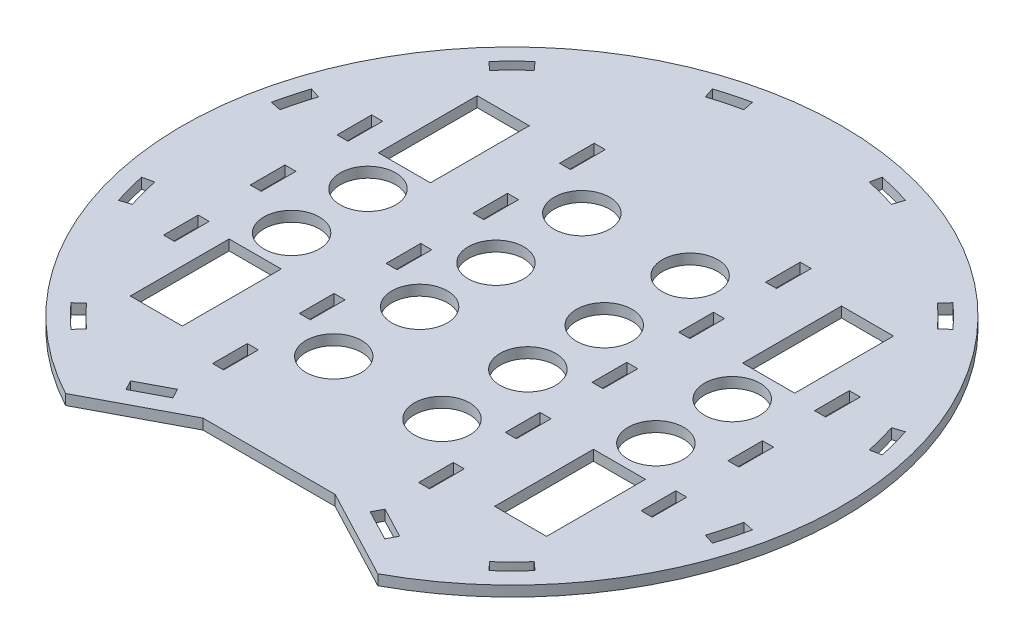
from build123d import *

# Parameters (mm, degrees)
SKETCH1_R           = 16
SKETCH1_W           = 30
SKETCH1_H           = 57
SKETCH1_W_2         = 6.35
SKETCH1_H_2         = 20
BOSS_EXTRUDE1_DEPTH = 6


with BuildPart() as part:
    # Sketch1 → Boss-Extrude1 (new body)
    with BuildSketch(Plane(origin=(0, 0, 0), x_dir=(1, 0, 0), z_dir=(0, 1, 0))):
        with BuildLine():
            Line((-90, -167.332005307), (-38.1, -140))
            Line((-38.1, -140), (38.1, -140))
            Line((38.1, -140), (90, -167.332005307))
            ThreePointArc((90, -167.332005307), (0, 190), (-90, -167.332005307))
        make_face()
        with Locations(Location((-105, -22.009925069, 0), (0, 0, 270))):
            Circle(SKETCH1_R, mode=Mode.SUBTRACT)
        with Locations(Location((-105, 22.009925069, 0), (0, 0, 270))):
            Circle(SKETCH1_R, mode=Mode.SUBTRACT)
        with Locations(Location((105, 22.009925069, 0), (0, 0, 270))):
            Circle(SKETCH1_R, mode=Mode.SUBTRACT)
        with Locations(Location((105, -22.009925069, 0), (0, 0, 270))):
            Circle(SKETCH1_R, mode=Mode.SUBTRACT)
        with Locations(Location((-31.203328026, 22.009925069, 0), (0, 0, 270))):
            Circle(SKETCH1_R, mode=Mode.SUBTRACT)
        with Locations(Location((-31.203328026, 71.509925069, 0), (0, 0, 270))):
            Circle(SKETCH1_R, mode=Mode.SUBTRACT)
        with Locations(Location((-31.203328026, -22.009925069, 0), (0, 0, 270))):
            Circle(SKETCH1_R, mode=Mode.SUBTRACT)
        with Locations(Location((-31.203328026, -71.509925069, 0), (0, 0, 270))):
            Circle(SKETCH1_R, mode=Mode.SUBTRACT)
        with Locations(Location((31.203328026, -71.509925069, 0), (0, 0, 270))):
            Circle(SKETCH1_R, mode=Mode.SUBTRACT)
        with Locations(Location((31.203328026, -22.009925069, 0), (0, 0, 270))):
            Circle(SKETCH1_R, mode=Mode.SUBTRACT)
        with Locations(Location((31.203328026, 71.509925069, 0), (0, 0, 270))):
            Circle(SKETCH1_R, mode=Mode.SUBTRACT)
        with Locations(Location((31.203328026, 22.009925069, 0), (0, 0, 270))):
            Circle(SKETCH1_R, mode=Mode.SUBTRACT)
        with Locations((-105, -71.509925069)):
            Rectangle(SKETCH1_W, SKETCH1_H, mode=Mode.SUBTRACT)
        with Locations((-105, 71.509925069)):
            Rectangle(SKETCH1_W, SKETCH1_H, mode=Mode.SUBTRACT)
        with Locations((105, 71.509925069)):
            Rectangle(SKETCH1_W, SKETCH1_H, mode=Mode.SUBTRACT)
        with Locations((105, -71.509925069)):
            Rectangle(SKETCH1_W, SKETCH1_H, mode=Mode.SUBTRACT)
        with Locations((137.675, -50)):
            Rectangle(SKETCH1_W_2, SKETCH1_H_2, mode=Mode.SUBTRACT)
        with Locations((-137.675, 50)):
            Rectangle(SKETCH1_W_2, SKETCH1_H_2, mode=Mode.SUBTRACT)
        with Locations((-137.675, 0)):
            Rectangle(SKETCH1_W_2, SKETCH1_H_2, mode=Mode.SUBTRACT)
        with Locations((-137.675, -50)):
            Rectangle(SKETCH1_W_2, SKETCH1_H_2, mode=Mode.SUBTRACT)
        with Locations((137.675, 0)):
            Rectangle(SKETCH1_W_2, SKETCH1_H_2, mode=Mode.SUBTRACT)
        with Locations((137.675, 50)):
            Rectangle(SKETCH1_W_2, SKETCH1_H_2, mode=Mode.SUBTRACT)
        with BuildLine():
            Line((-53.660801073, 165.150964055), (-55.623058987, 171.190172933))
            ThreePointArc((-55.623058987, 171.190172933), (-46.587428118, 173.866648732), (-37.424104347, 176.066568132))
            Line((-37.424104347, 176.066568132), (-36.103865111, 169.855330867))
            ThreePointArc((-36.103865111, 169.855330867), (-44.943927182, 167.733019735), (-53.660801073, 165.150964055))
        make_face(mode=Mode.SUBTRACT)
        with BuildLine():
            Line((-120.443509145, 133.766068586), (-116.194529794, 129.047098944))
            ThreePointArc((-116.194529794, 129.047098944), (-122.789092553, 122.789092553), (-129.047098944, 116.194529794))
            Line((-129.047098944, 116.194529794), (-133.766068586, 120.443509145))
            ThreePointArc((-133.766068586, 120.443509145), (-127.279220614, 127.279220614), (-120.443509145, 133.766068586))
        make_face(mode=Mode.SUBTRACT)
        with BuildLine():
            Line((-171.190172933, 55.623058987), (-165.150964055, 53.660801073))
            ThreePointArc((-165.150964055, 53.660801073), (-167.733019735, 44.943927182), (-169.855330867, 36.103865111))
            Line((-169.855330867, 36.103865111), (-176.066568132, 37.424104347))
            ThreePointArc((-176.066568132, 37.424104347), (-173.866648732, 46.587428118), (-171.190172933, 55.623058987))
        make_face(mode=Mode.SUBTRACT)
        with BuildLine():
            Line((-176.066568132, -37.424104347), (-169.855330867, -36.103865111))
            ThreePointArc((-169.855330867, -36.103865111), (-167.733019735, -44.943927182), (-165.150964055, -53.660801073))
            Line((-165.150964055, -53.660801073), (-171.190172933, -55.623058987))
            ThreePointArc((-171.190172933, -55.623058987), (-173.866648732, -46.587428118), (-176.066568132, -37.424104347))
        make_face(mode=Mode.SUBTRACT)
        with BuildLine():
            Line((-133.766068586, -120.443509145), (-129.047098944, -116.194529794))
            ThreePointArc((-129.047098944, -116.194529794), (-122.789092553, -122.789092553), (-116.194529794, -129.047098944))
            Line((-116.194529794, -129.047098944), (-120.443509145, -133.766068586))
            ThreePointArc((-120.443509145, -133.766068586), (-127.279220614, -127.279220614), (-133.766068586, -120.443509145))
        make_face(mode=Mode.SUBTRACT)
        with Locations((59.378328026, 0)):
            Rectangle(SKETCH1_W_2, SKETCH1_H_2, mode=Mode.SUBTRACT)
        with BuildLine():
            Line((116.194529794, -129.047098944), (120.443509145, -133.766068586))
            ThreePointArc((120.443509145, -133.766068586), (127.279220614, -127.279220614), (133.766068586, -120.443509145))
            Line((133.766068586, -120.443509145), (129.047098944, -116.194529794))
            ThreePointArc((129.047098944, -116.194529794), (122.789092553, -122.789092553), (116.194529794, -129.047098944))
        make_face(mode=Mode.SUBTRACT)
        with BuildLine():
            Line((165.150964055, -53.660801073), (171.190172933, -55.623058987))
            ThreePointArc((171.190172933, -55.623058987), (173.866648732, -46.587428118), (176.066568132, -37.424104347))
            Line((176.066568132, -37.424104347), (169.855330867, -36.103865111))
            ThreePointArc((169.855330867, -36.103865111), (167.733019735, -44.943927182), (165.150964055, -53.660801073))
        make_face(mode=Mode.SUBTRACT)
        with BuildLine():
            Line((169.855330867, 36.103865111), (176.066568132, 37.424104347))
            ThreePointArc((176.066568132, 37.424104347), (173.866648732, 46.587428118), (171.190172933, 55.623058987))
            Line((171.190172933, 55.623058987), (165.150964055, 53.660801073))
            ThreePointArc((165.150964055, 53.660801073), (167.733019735, 44.943927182), (169.855330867, 36.103865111))
        make_face(mode=Mode.SUBTRACT)
        with BuildLine():
            Line((129.047098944, 116.194529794), (133.766068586, 120.443509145))
            ThreePointArc((133.766068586, 120.443509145), (127.279220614, 127.279220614), (120.443509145, 133.766068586))
            Line((120.443509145, 133.766068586), (116.194529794, 129.047098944))
            ThreePointArc((116.194529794, 129.047098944), (122.789092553, 122.789092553), (129.047098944, 116.194529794))
        make_face(mode=Mode.SUBTRACT)
        with BuildLine():
            Line((37.424104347, 176.066568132), (36.103865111, 169.855330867))
            ThreePointArc((36.103865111, 169.855330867), (44.943927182, 167.733019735), (53.660801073, 165.150964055))
            Line((53.660801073, 165.150964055), (55.623058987, 171.190172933))
            ThreePointArc((55.623058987, 171.190172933), (46.587428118, 173.866648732), (37.424104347, 176.066568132))
        make_face(mode=Mode.SUBTRACT)
        Polygon((-56.879281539, -138.587765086), (-59.838145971, -132.969258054), (-77.534231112, -142.288516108), (-74.57536668, -147.90702314), align=None, mode=Mode.SUBTRACT)
        Polygon((77.534231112, -142.288516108), (74.57536668, -147.90702314), (56.879281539, -138.587765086), (59.838145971, -132.969258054), align=None, mode=Mode.SUBTRACT)
        with Locations((-59.378328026, 50)):
            Rectangle(SKETCH1_W_2, SKETCH1_H_2, mode=Mode.SUBTRACT)
        with Locations((-59.378328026, 0)):
            Rectangle(SKETCH1_W_2, SKETCH1_H_2, mode=Mode.SUBTRACT)
        with Locations((-59.378328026, 100)):
            Rectangle(SKETCH1_W_2, SKETCH1_H_2, mode=Mode.SUBTRACT)
        with Locations((-59.378328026, -50)):
            Rectangle(SKETCH1_W_2, SKETCH1_H_2, mode=Mode.SUBTRACT)
        with Locations((-59.378328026, -100)):
            Rectangle(SKETCH1_W_2, SKETCH1_H_2, mode=Mode.SUBTRACT)
        with Locations((59.378328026, -50)):
            Rectangle(SKETCH1_W_2, SKETCH1_H_2, mode=Mode.SUBTRACT)
        with Locations((59.378328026, -100)):
            Rectangle(SKETCH1_W_2, SKETCH1_H_2, mode=Mode.SUBTRACT)
        with Locations((59.378328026, 100)):
            Rectangle(SKETCH1_W_2, SKETCH1_H_2, mode=Mode.SUBTRACT)
        with Locations((59.378328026, 50)):
            Rectangle(SKETCH1_W_2, SKETCH1_H_2, mode=Mode.SUBTRACT)
    extrude(amount=BOSS_EXTRUDE1_DEPTH)


solid = part.part
